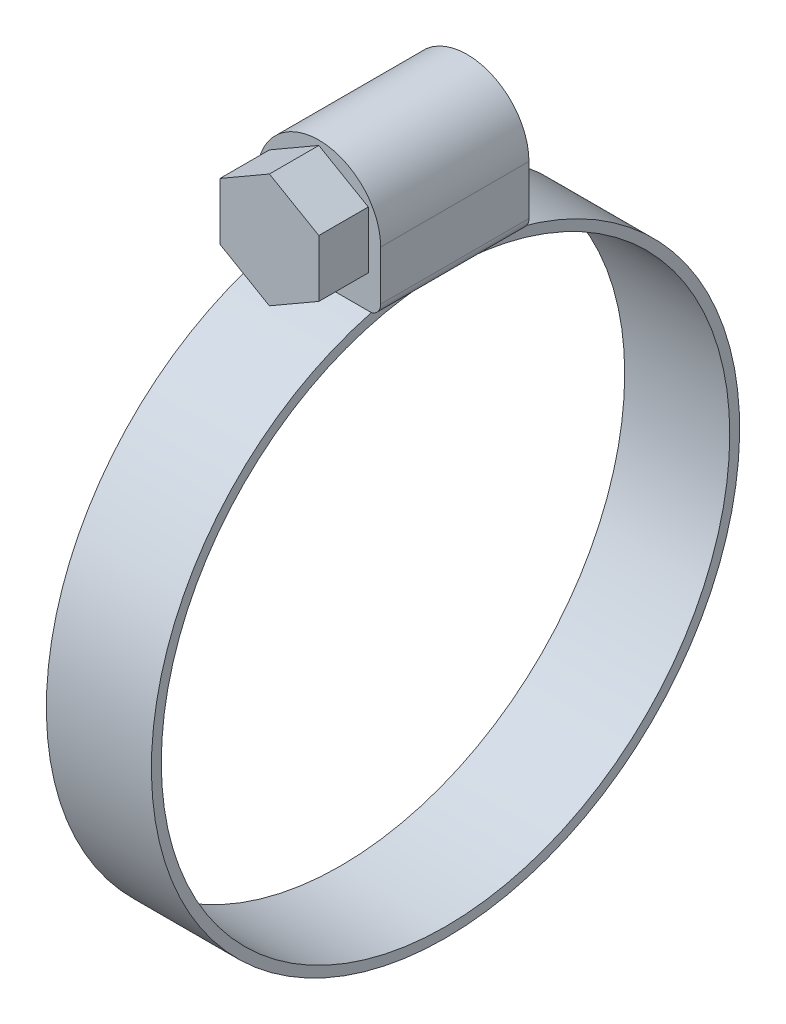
from build123d import *

# Parameters (mm, degrees)
SKETCH_1_W      = 8.5
SKETCH_1_H      = 0.8
EXTRUDE_1_DEPTH = 6
EXTRUDE_2_DEPTH = 4


with BuildPart() as part:
    # Sketch 1 → Revolve 1 (revolve)
    with BuildSketch(Plane.XY, mode=Mode.PRIVATE) as revolve_1_sk:
        with Locations((4.25, 23.4)):
            Rectangle(SKETCH_1_W, SKETCH_1_H)
    revolve(revolve_1_sk.sketch.rotate(Axis((0, 0, 0), (1, 0, 0)), 90), axis=Axis((0, 0, 0), (1, 0, 0)))

    # Sketch 2 → Extrude 1 (add, symmetric)
    with BuildSketch(Plane.XY):
        with BuildLine():
            Line((-0.75, 28), (-0.75, 24))
            ThreePointArc((-0.75, 24), (-0.457106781, 23.292893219), (0.25, 23))
            Line((0.25, 23), (8.25, 23))
            ThreePointArc((8.25, 23), (8.957106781, 23.292893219), (9.25, 24))
            Line((9.25, 24), (9.25, 28))
            ThreePointArc((9.25, 28), (4.25, 33), (-0.75, 28))
        make_face()
    extrude(amount=EXTRUDE_1_DEPTH, both=True)

    # Sketch 3 → Extrude 2 (add)
    with BuildSketch(Plane.XY.offset(6)):
        Polygon((8.25, 25.690598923), (8.25, 30.309401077), (4.25, 32.618802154), (0.25, 30.309401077), (0.25, 25.690598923), (4.25, 23.381197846), align=None)
    extrude(amount=EXTRUDE_2_DEPTH)


solid = part.part
